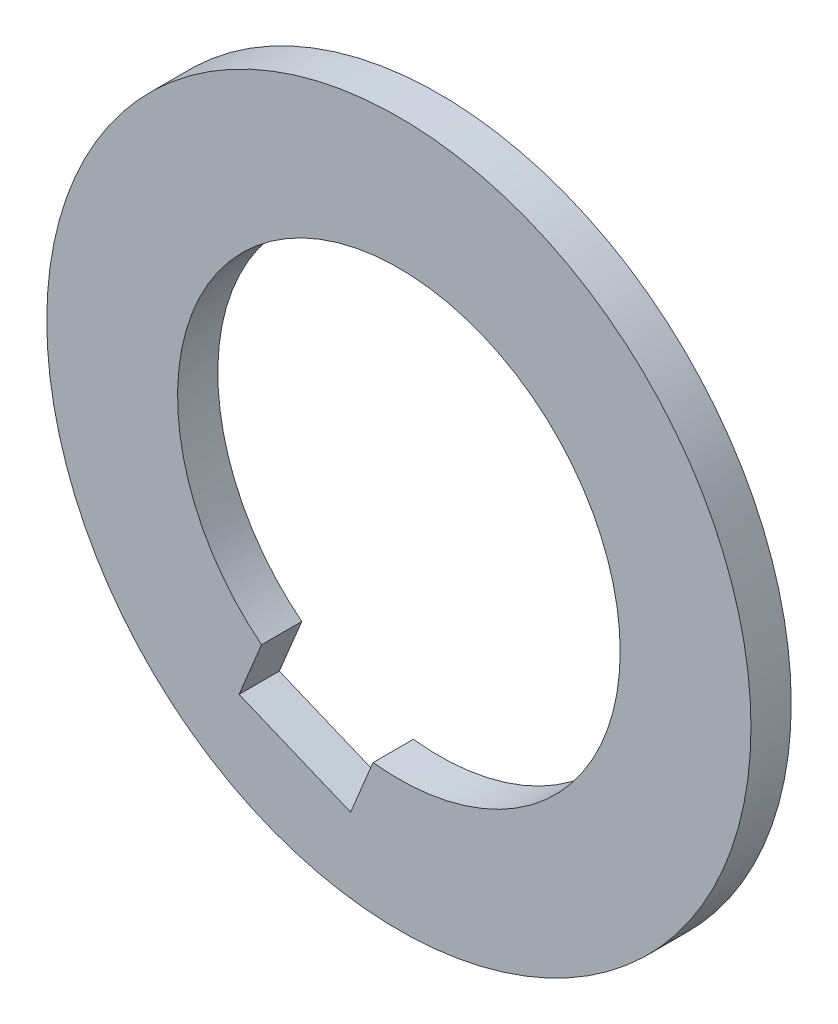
ISO-10303-21;
HEADER;
FILE_DESCRIPTION(('STEP AP214'),'2;1');
FILE_NAME('part.step','',(''),(''),'','','');
FILE_SCHEMA(('AUTOMOTIVE_DESIGN { 1 0 10303 214 1 1 1 1 }'));
ENDSEC;
DATA;
#1=APPLICATION_CONTEXT('core data for automotive mechanical design processes');
#2=APPLICATION_PROTOCOL_DEFINITION('international standard','automotive_design',2000,#1);
#3=PRODUCT_CONTEXT('',#1,'mechanical');
#4=PRODUCT('Part','Part','',(#3));
#5=PRODUCT_RELATED_PRODUCT_CATEGORY('part','',(#4));
#6=PRODUCT_DEFINITION_FORMATION('','',#4);
#7=PRODUCT_DEFINITION_CONTEXT('part definition',#1,'design');
#8=PRODUCT_DEFINITION('design','',#6,#7);
#9=PRODUCT_DEFINITION_SHAPE('','',#8);
#10=(LENGTH_UNIT() NAMED_UNIT(*) SI_UNIT(.MILLI.,.METRE.));
#11=(NAMED_UNIT(*) PLANE_ANGLE_UNIT() SI_UNIT($,.RADIAN.));
#12=(NAMED_UNIT(*) SI_UNIT($,.STERADIAN.) SOLID_ANGLE_UNIT());
#13=UNCERTAINTY_MEASURE_WITH_UNIT(LENGTH_MEASURE(1.E-05),#10,'distance_accuracy_value','');
#14=(GEOMETRIC_REPRESENTATION_CONTEXT(3) GLOBAL_UNCERTAINTY_ASSIGNED_CONTEXT((#13)) GLOBAL_UNIT_ASSIGNED_CONTEXT((#10,
#11,#12)) REPRESENTATION_CONTEXT('',''));
#15=CARTESIAN_POINT('',(0.,0.,0.));
#16=DIRECTION('',(0.,0.,1.));
#17=DIRECTION('',(1.,0.,0.));
#18=AXIS2_PLACEMENT_3D('',#15,#16,#17);
#19=CARTESIAN_POINT('',(0.,0.,2.));
#20=DIRECTION('',(0.,0.,1.));
#21=DIRECTION('',(1.,0.,0.));
#22=AXIS2_PLACEMENT_3D('',#19,#20,#21);
#23=PLANE('',#22);
#24=CARTESIAN_POINT('',(0.,0.,2.));
#25=DIRECTION('',(0.,0.,1.));
#26=DIRECTION('',(1.,0.,0.));
#27=AXIS2_PLACEMENT_3D('',#24,#25,#26);
#28=CIRCLE('',#27,17.5);
#29=CARTESIAN_POINT('',(17.5,0.,2.));
#30=VERTEX_POINT('',#29);
#31=EDGE_CURVE('E11',#30,#30,#28,.T.);
#32=ORIENTED_EDGE('',*,*,#31,.T.);
#33=EDGE_LOOP('',(#32));
#34=FACE_BOUND('',#33,.T.);
#35=DIRECTION('',(-0.383049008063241,-0.923728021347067,0.));
#36=VECTOR('',#35,1.);
#37=CARTESIAN_POINT('',(-7.94234567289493,-11.3211812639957,2.));
#38=LINE('',#37,#36);
#39=CARTESIAN_POINT('',(-6.82499372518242,-8.62667146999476,2.));
#40=VERTEX_POINT('',#39);
#41=CARTESIAN_POINT('',(-7.94234567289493,-11.3211812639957,2.));
#42=VERTEX_POINT('',#41);
#43=EDGE_CURVE('E82',#40,#42,#38,.T.);
#44=ORIENTED_EDGE('',*,*,#43,.F.);
#45=CARTESIAN_POINT('',(0.,0.,2.));
#46=DIRECTION('',(0.,0.,1.));
#47=DIRECTION('',(1.,0.,0.));
#48=AXIS2_PLACEMENT_3D('',#45,#46,#47);
#49=CIRCLE('',#48,11.);
#50=CARTESIAN_POINT('',(-1.2826255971,-10.9249655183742,2.));
#51=VERTEX_POINT('',#50);
#52=EDGE_CURVE('E74',#51,#40,#49,.T.);
#53=ORIENTED_EDGE('',*,*,#52,.F.);
#54=DIRECTION('',(0.383049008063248,0.923728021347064,0.));
#55=VECTOR('',#54,1.);
#56=CARTESIAN_POINT('',(-1.2826255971,-10.9249655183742,2.));
#57=LINE('',#56,#55);
#58=CARTESIAN_POINT('',(-2.39997754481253,-13.6194753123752,2.));
#59=VERTEX_POINT('',#58);
#60=EDGE_CURVE('E95',#59,#51,#57,.T.);
#61=ORIENTED_EDGE('',*,*,#60,.F.);
#62=DIRECTION('',(0.923728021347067,-0.383049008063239,0.));
#63=VECTOR('',#62,1.);
#64=CARTESIAN_POINT('',(-2.39997754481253,-13.6194753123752,2.));
#65=LINE('',#64,#63);
#66=EDGE_CURVE('E93',#42,#59,#65,.T.);
#67=ORIENTED_EDGE('',*,*,#66,.F.);
#68=EDGE_LOOP('',(#44,#53,#61,#67));
#69=FACE_BOUND('',#68,.T.);
#70=ADVANCED_FACE('F33',(#34,#69),#23,.T.);
#71=CARTESIAN_POINT('',(0.,0.,0.));
#72=DIRECTION('',(0.,0.,1.));
#73=DIRECTION('',(1.,0.,0.));
#74=AXIS2_PLACEMENT_3D('',#71,#72,#73);
#75=PLANE('',#74);
#76=CARTESIAN_POINT('',(0.,0.,0.));
#77=DIRECTION('',(0.,0.,1.));
#78=DIRECTION('',(1.,0.,0.));
#79=AXIS2_PLACEMENT_3D('',#76,#77,#78);
#80=CIRCLE('',#79,17.5);
#81=CARTESIAN_POINT('',(17.5,0.,0.));
#82=VERTEX_POINT('',#81);
#83=EDGE_CURVE('E37',#82,#82,#80,.T.);
#84=ORIENTED_EDGE('',*,*,#83,.F.);
#85=EDGE_LOOP('',(#84));
#86=FACE_BOUND('',#85,.T.);
#87=CARTESIAN_POINT('',(0.,0.,0.));
#88=DIRECTION('',(0.,0.,1.));
#89=DIRECTION('',(1.,0.,0.));
#90=AXIS2_PLACEMENT_3D('',#87,#88,#89);
#91=CIRCLE('',#90,11.);
#92=CARTESIAN_POINT('',(-1.2826255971,-10.9249655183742,0.));
#93=VERTEX_POINT('',#92);
#94=CARTESIAN_POINT('',(-6.82499372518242,-8.62667146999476,0.));
#95=VERTEX_POINT('',#94);
#96=EDGE_CURVE('E56',#93,#95,#91,.T.);
#97=ORIENTED_EDGE('',*,*,#96,.T.);
#98=DIRECTION('',(-0.383049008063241,-0.923728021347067,0.));
#99=VECTOR('',#98,1.);
#100=CARTESIAN_POINT('',(-7.94234567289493,-11.3211812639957,0.));
#101=LINE('',#100,#99);
#102=CARTESIAN_POINT('',(-7.94234567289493,-11.3211812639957,0.));
#103=VERTEX_POINT('',#102);
#104=EDGE_CURVE('E89',#95,#103,#101,.T.);
#105=ORIENTED_EDGE('',*,*,#104,.T.);
#106=DIRECTION('',(0.923728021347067,-0.383049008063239,0.));
#107=VECTOR('',#106,1.);
#108=CARTESIAN_POINT('',(-2.39997754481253,-13.6194753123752,0.));
#109=LINE('',#108,#107);
#110=CARTESIAN_POINT('',(-2.39997754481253,-13.6194753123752,0.));
#111=VERTEX_POINT('',#110);
#112=EDGE_CURVE('E101',#103,#111,#109,.T.);
#113=ORIENTED_EDGE('',*,*,#112,.T.);
#114=DIRECTION('',(0.383049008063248,0.923728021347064,0.));
#115=VECTOR('',#114,1.);
#116=CARTESIAN_POINT('',(-1.2826255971,-10.9249655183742,0.));
#117=LINE('',#116,#115);
#118=EDGE_CURVE('E83',#111,#93,#117,.T.);
#119=ORIENTED_EDGE('',*,*,#118,.T.);
#120=EDGE_LOOP('',(#97,#105,#113,#119));
#121=FACE_BOUND('',#120,.T.);
#122=ADVANCED_FACE('F112',(#86,#121),#75,.F.);
#123=CARTESIAN_POINT('',(0.,0.,2.));
#124=DIRECTION('',(0.,0.,-1.));
#125=DIRECTION('',(-1.,0.,0.));
#126=AXIS2_PLACEMENT_3D('',#123,#124,#125);
#127=CYLINDRICAL_SURFACE('',#126,17.5);
#128=ORIENTED_EDGE('',*,*,#31,.F.);
#129=EDGE_LOOP('',(#128));
#130=FACE_BOUND('',#129,.T.);
#131=ORIENTED_EDGE('',*,*,#83,.T.);
#132=EDGE_LOOP('',(#131));
#133=FACE_BOUND('',#132,.T.);
#134=ADVANCED_FACE('F35',(#130,#133),#127,.T.);
#135=CARTESIAN_POINT('',(0.,0.,2.));
#136=DIRECTION('',(0.,0.,-1.));
#137=DIRECTION('',(-1.,0.,0.));
#138=AXIS2_PLACEMENT_3D('',#135,#136,#137);
#139=CYLINDRICAL_SURFACE('',#138,11.);
#140=ORIENTED_EDGE('',*,*,#96,.F.);
#141=DIRECTION('',(0.,0.,-1.));
#142=VECTOR('',#141,1.);
#143=CARTESIAN_POINT('',(-1.2826255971,-10.9249655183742,2.));
#144=LINE('',#143,#142);
#145=EDGE_CURVE('E78',#51,#93,#144,.T.);
#146=ORIENTED_EDGE('',*,*,#145,.F.);
#147=ORIENTED_EDGE('',*,*,#52,.T.);
#148=DIRECTION('',(0.,0.,-1.));
#149=VECTOR('',#148,1.);
#150=CARTESIAN_POINT('',(-6.82499372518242,-8.62667146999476,2.));
#151=LINE('',#150,#149);
#152=EDGE_CURVE('E77',#40,#95,#151,.T.);
#153=ORIENTED_EDGE('',*,*,#152,.T.);
#154=EDGE_LOOP('',(#140,#146,#147,#153));
#155=FACE_BOUND('',#154,.T.);
#156=ADVANCED_FACE('F76',(#155),#139,.F.);
#157=CARTESIAN_POINT('',(-7.94234567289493,-11.3211812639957,2.));
#158=DIRECTION('',(0.923728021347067,-0.383049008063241,0.));
#159=DIRECTION('',(0.383049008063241,0.923728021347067,0.));
#160=AXIS2_PLACEMENT_3D('',#157,#158,#159);
#161=PLANE('',#160);
#162=ORIENTED_EDGE('',*,*,#104,.F.);
#163=ORIENTED_EDGE('',*,*,#152,.F.);
#164=ORIENTED_EDGE('',*,*,#43,.T.);
#165=DIRECTION('',(0.,0.,-1.));
#166=VECTOR('',#165,1.);
#167=CARTESIAN_POINT('',(-7.94234567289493,-11.3211812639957,2.));
#168=LINE('',#167,#166);
#169=EDGE_CURVE('E90',#42,#103,#168,.T.);
#170=ORIENTED_EDGE('',*,*,#169,.T.);
#171=EDGE_LOOP('',(#162,#163,#164,#170));
#172=FACE_BOUND('',#171,.T.);
#173=ADVANCED_FACE('F86',(#172),#161,.T.);
#174=CARTESIAN_POINT('',(-2.39997754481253,-13.6194753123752,2.));
#175=DIRECTION('',(0.383049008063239,0.923728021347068,0.));
#176=DIRECTION('',(-0.923728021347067,0.383049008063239,0.));
#177=AXIS2_PLACEMENT_3D('',#174,#175,#176);
#178=PLANE('',#177);
#179=ORIENTED_EDGE('',*,*,#112,.F.);
#180=ORIENTED_EDGE('',*,*,#169,.F.);
#181=ORIENTED_EDGE('',*,*,#66,.T.);
#182=DIRECTION('',(0.,0.,-1.));
#183=VECTOR('',#182,1.);
#184=CARTESIAN_POINT('',(-2.39997754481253,-13.6194753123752,2.));
#185=LINE('',#184,#183);
#186=EDGE_CURVE('E48',#59,#111,#185,.T.);
#187=ORIENTED_EDGE('',*,*,#186,.T.);
#188=EDGE_LOOP('',(#179,#180,#181,#187));
#189=FACE_BOUND('',#188,.T.);
#190=ADVANCED_FACE('F110',(#189),#178,.T.);
#191=CARTESIAN_POINT('',(-1.2826255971,-10.9249655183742,2.));
#192=DIRECTION('',(-0.923728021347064,0.383049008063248,0.));
#193=DIRECTION('',(-0.383049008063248,-0.923728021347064,0.));
#194=AXIS2_PLACEMENT_3D('',#191,#192,#193);
#195=PLANE('',#194);
#196=ORIENTED_EDGE('',*,*,#118,.F.);
#197=ORIENTED_EDGE('',*,*,#186,.F.);
#198=ORIENTED_EDGE('',*,*,#60,.T.);
#199=ORIENTED_EDGE('',*,*,#145,.T.);
#200=EDGE_LOOP('',(#196,#197,#198,#199));
#201=FACE_BOUND('',#200,.T.);
#202=ADVANCED_FACE('F113',(#201),#195,.T.);
#203=CLOSED_SHELL('',(#70,#122,#134,#156,#173,#190,#202));
#204=MANIFOLD_SOLID_BREP('B2',#203);
#205=ADVANCED_BREP_SHAPE_REPRESENTATION('',(#18,#204),#14);
#206=SHAPE_DEFINITION_REPRESENTATION(#9,#205);
ENDSEC;
END-ISO-10303-21;
